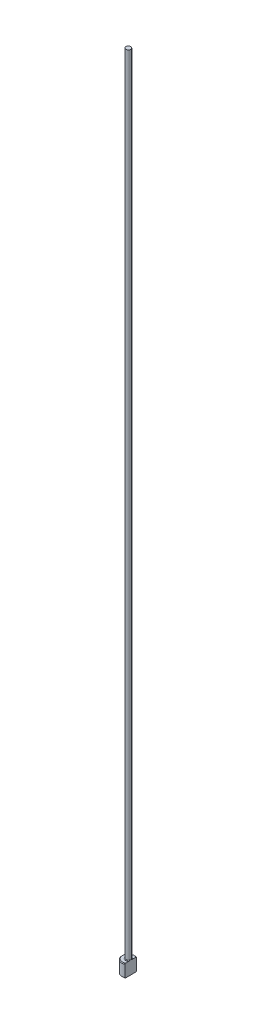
ISO-10303-21;
HEADER;
FILE_DESCRIPTION(('STEP AP214'),'2;1');
FILE_NAME('part.step','',(''),(''),'','','');
FILE_SCHEMA(('AUTOMOTIVE_DESIGN { 1 0 10303 214 1 1 1 1 }'));
ENDSEC;
DATA;
#1=APPLICATION_CONTEXT('core data for automotive mechanical design processes');
#2=APPLICATION_PROTOCOL_DEFINITION('international standard','automotive_design',2000,#1);
#3=PRODUCT_CONTEXT('',#1,'mechanical');
#4=PRODUCT('Part','Part','',(#3));
#5=PRODUCT_RELATED_PRODUCT_CATEGORY('part','',(#4));
#6=PRODUCT_DEFINITION_FORMATION('','',#4);
#7=PRODUCT_DEFINITION_CONTEXT('part definition',#1,'design');
#8=PRODUCT_DEFINITION('design','',#6,#7);
#9=PRODUCT_DEFINITION_SHAPE('','',#8);
#10=(LENGTH_UNIT() NAMED_UNIT(*) SI_UNIT(.MILLI.,.METRE.));
#11=(NAMED_UNIT(*) PLANE_ANGLE_UNIT() SI_UNIT($,.RADIAN.));
#12=(NAMED_UNIT(*) SI_UNIT($,.STERADIAN.) SOLID_ANGLE_UNIT());
#13=UNCERTAINTY_MEASURE_WITH_UNIT(LENGTH_MEASURE(1.E-05),#10,'distance_accuracy_value','');
#14=(GEOMETRIC_REPRESENTATION_CONTEXT(3) GLOBAL_UNCERTAINTY_ASSIGNED_CONTEXT((#13)) GLOBAL_UNIT_ASSIGNED_CONTEXT((#10,
#11,#12)) REPRESENTATION_CONTEXT('',''));
#15=CARTESIAN_POINT('',(0.,0.,0.));
#16=DIRECTION('',(0.,0.,1.));
#17=DIRECTION('',(1.,0.,0.));
#18=AXIS2_PLACEMENT_3D('',#15,#16,#17);
#19=CARTESIAN_POINT('',(0.,0.,0.));
#20=DIRECTION('',(0.,-1.,0.));
#21=DIRECTION('',(0.,0.,-1.));
#22=AXIS2_PLACEMENT_3D('',#19,#20,#21);
#23=PLANE('',#22);
#24=CARTESIAN_POINT('',(0.,0.,0.));
#25=DIRECTION('',(0.,-1.,0.));
#26=DIRECTION('',(0.,0.,-1.));
#27=AXIS2_PLACEMENT_3D('',#24,#25,#26);
#28=CIRCLE('',#27,1.8);
#29=CARTESIAN_POINT('',(0.749999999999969,0.,1.63630681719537));
#30=VERTEX_POINT('',#29);
#31=CARTESIAN_POINT('',(0.749999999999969,0.,-1.63630681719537));
#32=VERTEX_POINT('',#31);
#33=EDGE_CURVE('E98',#30,#32,#28,.T.);
#34=ORIENTED_EDGE('',*,*,#33,.T.);
#35=DIRECTION('',(0.,0.,1.));
#36=VECTOR('',#35,1.);
#37=CARTESIAN_POINT('',(0.749999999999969,0.,1.85404962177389));
#38=LINE('',#37,#36);
#39=EDGE_CURVE('E83',#32,#30,#38,.T.);
#40=ORIENTED_EDGE('',*,*,#39,.T.);
#41=EDGE_LOOP('',(#34,#40));
#42=FACE_BOUND('',#41,.T.);
#43=ADVANCED_FACE('F32',(#42),#23,.T.);
#44=CARTESIAN_POINT('',(0.,259.958771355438,0.));
#45=DIRECTION('',(0.,1.,0.));
#46=DIRECTION('',(0.,0.,1.));
#47=AXIS2_PLACEMENT_3D('',#44,#45,#46);
#48=CYLINDRICAL_SURFACE('',#47,1.99999999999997);
#49=CARTESIAN_POINT('',(0.,3.80000000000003,0.));
#50=DIRECTION('',(0.,1.,0.));
#51=DIRECTION('',(0.,0.,1.));
#52=AXIS2_PLACEMENT_3D('',#49,#50,#51);
#53=CIRCLE('',#52,1.99999999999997);
#54=CARTESIAN_POINT('',(0.749999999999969,3.80000000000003,1.85404962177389));
#55=VERTEX_POINT('',#54);
#56=CARTESIAN_POINT('',(0.749999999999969,3.80000000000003,-1.85404962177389));
#57=VERTEX_POINT('',#56);
#58=EDGE_CURVE('E104',#55,#57,#53,.F.);
#59=ORIENTED_EDGE('',*,*,#58,.T.);
#60=DIRECTION('',(0.,-1.,0.));
#61=VECTOR('',#60,1.);
#62=CARTESIAN_POINT('',(0.749999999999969,250.,-1.85404962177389));
#63=LINE('',#62,#61);
#64=CARTESIAN_POINT('',(0.749999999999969,0.199999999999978,-1.85404962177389));
#65=VERTEX_POINT('',#64);
#66=EDGE_CURVE('E183',#57,#65,#63,.T.);
#67=ORIENTED_EDGE('',*,*,#66,.T.);
#68=CARTESIAN_POINT('',(0.,0.199999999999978,0.));
#69=DIRECTION('',(0.,-1.,0.));
#70=DIRECTION('',(0.,0.,-1.));
#71=AXIS2_PLACEMENT_3D('',#68,#69,#70);
#72=CIRCLE('',#71,1.99999999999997);
#73=CARTESIAN_POINT('',(0.749999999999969,0.199999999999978,1.85404962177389));
#74=VERTEX_POINT('',#73);
#75=EDGE_CURVE('E100',#65,#74,#72,.F.);
#76=ORIENTED_EDGE('',*,*,#75,.T.);
#77=DIRECTION('',(0.,-1.,0.));
#78=VECTOR('',#77,1.);
#79=CARTESIAN_POINT('',(0.749999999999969,250.,1.85404962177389));
#80=LINE('',#79,#78);
#81=EDGE_CURVE('E93',#55,#74,#80,.T.);
#82=ORIENTED_EDGE('',*,*,#81,.F.);
#83=EDGE_LOOP('',(#59,#67,#76,#82));
#84=FACE_BOUND('',#83,.T.);
#85=ADVANCED_FACE('F158',(#84),#48,.T.);
#86=CARTESIAN_POINT('',(-1.99999999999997,4.,0.));
#87=DIRECTION('',(0.,1.,0.));
#88=DIRECTION('',(0.,0.,1.));
#89=AXIS2_PLACEMENT_3D('',#86,#87,#88);
#90=PLANE('',#89);
#91=CARTESIAN_POINT('',(0.,4.,0.));
#92=DIRECTION('',(0.,1.,0.));
#93=DIRECTION('',(0.,0.,1.));
#94=AXIS2_PLACEMENT_3D('',#91,#92,#93);
#95=CIRCLE('',#94,1.80000000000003);
#96=CARTESIAN_POINT('',(0.749999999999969,4.,-1.6363068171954));
#97=VERTEX_POINT('',#96);
#98=CARTESIAN_POINT('',(0.749999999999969,4.,1.6363068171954));
#99=VERTEX_POINT('',#98);
#100=EDGE_CURVE('E178',#97,#99,#95,.T.);
#101=ORIENTED_EDGE('',*,*,#100,.T.);
#102=DIRECTION('',(0.,0.,-1.));
#103=VECTOR('',#102,1.);
#104=CARTESIAN_POINT('',(0.749999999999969,4.,0.));
#105=LINE('',#104,#103);
#106=CARTESIAN_POINT('',(0.749999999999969,3.99999999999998,0.583095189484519));
#107=VERTEX_POINT('',#106);
#108=EDGE_CURVE('E57',#99,#107,#105,.T.);
#109=ORIENTED_EDGE('',*,*,#108,.T.);
#110=CARTESIAN_POINT('',(0.,4.,0.));
#111=DIRECTION('',(0.,1.,0.));
#112=DIRECTION('',(0.,0.,1.));
#113=AXIS2_PLACEMENT_3D('',#110,#111,#112);
#114=CIRCLE('',#113,0.949999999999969);
#115=CARTESIAN_POINT('',(0.749999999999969,3.99999999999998,-0.583095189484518));
#116=VERTEX_POINT('',#115);
#117=EDGE_CURVE('E107',#107,#116,#114,.F.);
#118=ORIENTED_EDGE('',*,*,#117,.T.);
#119=EDGE_CURVE('E136',#116,#97,#105,.T.);
#120=ORIENTED_EDGE('',*,*,#119,.T.);
#121=EDGE_LOOP('',(#101,#109,#118,#120));
#122=FACE_BOUND('',#121,.T.);
#123=ADVANCED_FACE('F147',(#122),#90,.T.);
#124=CARTESIAN_POINT('',(0.,4.,0.));
#125=DIRECTION('',(0.,-1.,0.));
#126=DIRECTION('',(0.,0.,-1.));
#127=AXIS2_PLACEMENT_3D('',#124,#125,#126);
#128=CONICAL_SURFACE('',#127,1.80000000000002,0.785398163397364);
#129=ORIENTED_EDGE('',*,*,#58,.F.);
#130=CARTESIAN_POINT('',(0.749999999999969,1.6493344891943,4.08234297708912));
#131=CARTESIAN_POINT('',(0.749999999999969,1.75686328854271,3.9730094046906));
#132=CARTESIAN_POINT('',(0.749999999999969,1.86432546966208,3.86361021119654));
#133=CARTESIAN_POINT('',(0.749999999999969,2.07918719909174,3.64450528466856));
#134=CARTESIAN_POINT('',(0.749999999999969,2.18658653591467,3.53479934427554));
#135=CARTESIAN_POINT('',(0.749999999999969,2.40330928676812,3.31294195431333));
#136=CARTESIAN_POINT('',(0.749999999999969,2.51262786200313,3.20078577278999));
#137=CARTESIAN_POINT('',(0.749999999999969,2.73079905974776,2.97627027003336));
#138=CARTESIAN_POINT('',(0.749999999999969,2.83965207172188,2.86391132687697));
#139=CARTESIAN_POINT('',(0.749999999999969,3.12410072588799,2.56910579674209));
#140=CARTESIAN_POINT('',(0.749999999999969,3.29932702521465,2.38630095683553));
#141=CARTESIAN_POINT('',(0.749999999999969,3.56081447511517,2.11005080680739));
#142=CARTESIAN_POINT('',(0.749999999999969,3.64793893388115,2.01742399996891));
#143=CARTESIAN_POINT('',(0.749999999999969,3.82126966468,1.83139888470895));
#144=CARTESIAN_POINT('',(0.749999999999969,3.90747636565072,1.7380009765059));
#145=CARTESIAN_POINT('',(0.749999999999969,4.07705927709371,1.55161637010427));
#146=CARTESIAN_POINT('',(0.749999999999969,4.1604586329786,1.4586508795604));
#147=CARTESIAN_POINT('',(0.749999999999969,4.28399832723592,1.31767418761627));
#148=CARTESIAN_POINT('',(0.749999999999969,4.32495686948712,1.27038111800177));
#149=CARTESIAN_POINT('',(0.749999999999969,4.4061281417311,1.17516037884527));
#150=CARTESIAN_POINT('',(0.749999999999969,4.44634090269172,1.1272327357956));
#151=CARTESIAN_POINT('',(0.749999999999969,4.52542294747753,1.03092047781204));
#152=CARTESIAN_POINT('',(0.749999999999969,4.56430041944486,0.982542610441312));
#153=CARTESIAN_POINT('',(0.749999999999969,4.64060877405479,0.884663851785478));
#154=CARTESIAN_POINT('',(0.749999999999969,4.67803993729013,0.835163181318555));
#155=CARTESIAN_POINT('',(0.749999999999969,4.75064212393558,0.734748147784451));
#156=CARTESIAN_POINT('',(0.749999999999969,4.78581957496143,0.683838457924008));
#157=CARTESIAN_POINT('',(0.749999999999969,4.85281471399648,0.57986856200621));
#158=CARTESIAN_POINT('',(0.749999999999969,4.88463648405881,0.52681108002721));
#159=CARTESIAN_POINT('',(0.749999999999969,4.92004236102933,0.460353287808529));
#160=CARTESIAN_POINT('',(0.749999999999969,4.92626425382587,0.448355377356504));
#161=CARTESIAN_POINT('',(0.749999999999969,4.93840821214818,0.424205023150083));
#162=CARTESIAN_POINT('',(0.749999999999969,4.94433019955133,0.412052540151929));
#163=CARTESIAN_POINT('',(0.749999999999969,4.96159246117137,0.375357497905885));
#164=CARTESIAN_POINT('',(0.749999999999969,4.97243059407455,0.350574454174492));
#165=CARTESIAN_POINT('',(0.749999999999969,4.99232429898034,0.300598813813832));
#166=CARTESIAN_POINT('',(0.749999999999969,5.00139743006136,0.275413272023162));
#167=CARTESIAN_POINT('',(0.749999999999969,5.0175253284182,0.224391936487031));
#168=CARTESIAN_POINT('',(0.749999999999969,5.02458006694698,0.198556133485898));
#169=CARTESIAN_POINT('',(0.749999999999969,5.03526259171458,0.150878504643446));
#170=CARTESIAN_POINT('',(0.749999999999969,5.03927292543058,0.129123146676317));
#171=CARTESIAN_POINT('',(0.749999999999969,5.04546996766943,0.0853625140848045));
#172=CARTESIAN_POINT('',(0.749999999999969,5.04765728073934,0.0633573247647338));
#173=CARTESIAN_POINT('',(0.749999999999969,5.05127090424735,-0.00270951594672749));
#174=CARTESIAN_POINT('',(0.749999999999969,5.04978253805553,-0.0469656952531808));
#175=CARTESIAN_POINT('',(0.749999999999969,5.03814860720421,-0.143936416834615));
#176=CARTESIAN_POINT('',(0.749999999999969,5.02621240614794,-0.196426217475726));
#177=CARTESIAN_POINT('',(0.749999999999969,5.00214641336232,-0.273272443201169));
#178=CARTESIAN_POINT('',(0.749999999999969,4.9930477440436,-0.298672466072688));
#179=CARTESIAN_POINT('',(0.749999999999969,4.97317462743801,-0.348806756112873));
#180=CARTESIAN_POINT('',(0.749999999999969,4.96240055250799,-0.373541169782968));
#181=CARTESIAN_POINT('',(0.749999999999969,4.92901260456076,-0.444792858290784));
#182=CARTESIAN_POINT('',(0.749999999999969,4.90460879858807,-0.49046421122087));
#183=CARTESIAN_POINT('',(0.749999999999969,4.85261191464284,-0.579972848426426));
#184=CARTESIAN_POINT('',(0.749999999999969,4.82501493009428,-0.623807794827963));
#185=CARTESIAN_POINT('',(0.749999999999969,4.7675980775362,-0.710209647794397));
#186=CARTESIAN_POINT('',(0.749999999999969,4.73777062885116,-0.752771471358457));
#187=CARTESIAN_POINT('',(0.749999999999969,4.67663657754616,-0.836824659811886));
#188=CARTESIAN_POINT('',(0.749999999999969,4.64532962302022,-0.878315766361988));
#189=CARTESIAN_POINT('',(0.749999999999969,4.58120898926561,-0.96106431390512));
#190=CARTESIAN_POINT('',(0.749999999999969,4.54838018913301,-1.00230998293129));
#191=CARTESIAN_POINT('',(0.749999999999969,4.48192435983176,-1.08415466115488));
#192=CARTESIAN_POINT('',(0.749999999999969,4.44829728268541,-1.12475363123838));
#193=CARTESIAN_POINT('',(0.749999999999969,4.34669509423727,-1.24559513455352));
#194=CARTESIAN_POINT('',(0.749999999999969,4.2778337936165,-1.32509096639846));
#195=CARTESIAN_POINT('',(0.749999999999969,4.10242211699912,-1.52396732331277));
#196=CARTESIAN_POINT('',(0.749999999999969,3.99494650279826,-1.64252540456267));
#197=CARTESIAN_POINT('',(0.749999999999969,3.77825048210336,-1.8780457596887));
#198=CARTESIAN_POINT('',(0.749999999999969,3.66902991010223,-1.99500788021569));
#199=CARTESIAN_POINT('',(0.749999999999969,3.44939263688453,-2.22808772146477));
#200=CARTESIAN_POINT('',(0.749999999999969,3.33897457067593,-2.34420415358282));
#201=CARTESIAN_POINT('',(0.749999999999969,3.11746229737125,-2.57577975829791));
#202=CARTESIAN_POINT('',(0.749999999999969,3.00636811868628,-2.69123895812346));
#203=CARTESIAN_POINT('',(0.749999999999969,2.7917128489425,-2.91342601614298));
#204=CARTESIAN_POINT('',(0.749999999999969,2.68818407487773,-3.0201851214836));
#205=CARTESIAN_POINT('',(0.749999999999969,2.48083134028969,-3.23341885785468));
#206=CARTESIAN_POINT('',(0.749999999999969,2.37700737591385,-3.33989348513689));
#207=CARTESIAN_POINT('',(0.749999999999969,2.16930389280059,-3.55245914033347));
#208=CARTESIAN_POINT('',(0.749999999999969,2.0654247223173,-3.658550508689));
#209=CARTESIAN_POINT('',(0.749999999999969,1.85749599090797,-3.87056274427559));
#210=CARTESIAN_POINT('',(0.749999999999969,1.75344643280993,-3.97648361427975));
#211=CARTESIAN_POINT('',(0.749999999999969,1.6493344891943,-4.08234297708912));
#212=B_SPLINE_CURVE_WITH_KNOTS('',3,(#130,#131,#132,#133,#134,#135,#136,#137,#138,#139,#140,
#141,#142,#143,#144,#145,#146,#147,#148,#149,#150,#151,#152,#153,#154,#155,#156,#157,#158,#159,
#160,#161,#162,#163,#164,#165,#166,#167,#168,#169,#170,#171,#172,#173,#174,#175,#176,#177,#178,
#179,#180,#181,#182,#183,#184,#185,#186,#187,#188,#189,#190,#191,#192,#193,#194,#195,#196,#197,
#198,#199,#200,#201,#202,#203,#204,#205,#206,#207,#208,#209,#210,#211),.UNSPECIFIED.,.F.,.F.,(4,
2,2,2,2,2,2,2,2,2,2,2,2,2,2,2,2,2,2,2,2,2,2,2,2,2,2,2,2,2,2,2,2,2,2,2,2,2,2,2,4),(0.,
0.460050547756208,0.920626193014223,1.39048289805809,1.85980320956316,2.61945882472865,
3.00094349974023,3.38224127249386,3.75689298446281,3.94457922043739,4.1322576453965,
4.31843090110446,4.50456785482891,4.69014785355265,4.87549943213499,4.91604145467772,
4.95659398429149,5.03768920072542,5.11793098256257,5.19817390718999,5.26446717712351,
5.33073845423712,5.46284570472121,5.62332534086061,5.70422568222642,5.78510806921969,
5.940234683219,6.09555312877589,6.25142580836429,6.40733575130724,6.56546927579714,
6.72361232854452,7.03910022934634,7.51913300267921,7.99921158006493,8.47991142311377,
8.96059120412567,9.4067310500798,9.85287674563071,10.2983160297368,10.7437479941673),.UNSPECIFIED.);
#213=EDGE_CURVE('E135',#55,#99,#212,.T.);
#214=ORIENTED_EDGE('',*,*,#213,.T.);
#215=ORIENTED_EDGE('',*,*,#100,.F.);
#216=EDGE_CURVE('E127',#97,#57,#212,.T.);
#217=ORIENTED_EDGE('',*,*,#216,.T.);
#218=EDGE_LOOP('',(#129,#214,#215,#217));
#219=FACE_BOUND('',#218,.T.);
#220=ADVANCED_FACE('F143',(#219),#128,.T.);
#221=CARTESIAN_POINT('',(0.,0.199999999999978,0.));
#222=DIRECTION('',(0.,1.,0.));
#223=DIRECTION('',(0.,0.,1.));
#224=AXIS2_PLACEMENT_3D('',#221,#222,#223);
#225=CONICAL_SURFACE('',#224,1.99999999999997,0.785398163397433);
#226=ORIENTED_EDGE('',*,*,#75,.F.);
#227=CARTESIAN_POINT('',(0.749999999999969,2.3506655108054,-4.08234297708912));
#228=CARTESIAN_POINT('',(0.749999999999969,2.24313671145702,-3.97300940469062));
#229=CARTESIAN_POINT('',(0.749999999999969,2.13567453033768,-3.86361021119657));
#230=CARTESIAN_POINT('',(0.749999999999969,1.92081280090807,-3.64450528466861));
#231=CARTESIAN_POINT('',(0.749999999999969,1.81341346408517,-3.5347993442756));
#232=CARTESIAN_POINT('',(0.749999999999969,1.59669071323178,-3.31294195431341));
#233=CARTESIAN_POINT('',(0.749999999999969,1.48737213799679,-3.20078577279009));
#234=CARTESIAN_POINT('',(0.749999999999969,1.26920094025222,-2.97627027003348));
#235=CARTESIAN_POINT('',(0.749999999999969,1.16034792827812,-2.86391132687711));
#236=CARTESIAN_POINT('',(0.749999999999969,0.87589927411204,-2.56910579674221));
#237=CARTESIAN_POINT('',(0.749999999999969,0.700672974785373,-2.38630095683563));
#238=CARTESIAN_POINT('',(0.749999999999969,0.439185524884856,-2.11005080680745));
#239=CARTESIAN_POINT('',(0.749999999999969,0.352061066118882,-2.01742399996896));
#240=CARTESIAN_POINT('',(0.749999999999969,0.178730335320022,-1.83139888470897));
#241=CARTESIAN_POINT('',(0.749999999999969,0.0925236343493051,-1.73800097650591));
#242=CARTESIAN_POINT('',(0.749999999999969,-0.07705927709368,-1.55161637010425));
#243=CARTESIAN_POINT('',(0.749999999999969,-0.160458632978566,-1.45865087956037));
#244=CARTESIAN_POINT('',(0.749999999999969,-0.283998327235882,-1.31767418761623));
#245=CARTESIAN_POINT('',(0.749999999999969,-0.324956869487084,-1.27038111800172));
#246=CARTESIAN_POINT('',(0.749999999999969,-0.406128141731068,-1.17516037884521));
#247=CARTESIAN_POINT('',(0.749999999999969,-0.446340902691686,-1.12723273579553));
#248=CARTESIAN_POINT('',(0.749999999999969,-0.525422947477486,-1.03092047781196));
#249=CARTESIAN_POINT('',(0.749999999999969,-0.564300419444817,-0.982542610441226));
#250=CARTESIAN_POINT('',(0.749999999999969,-0.64060877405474,-0.88466385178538));
#251=CARTESIAN_POINT('',(0.749999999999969,-0.678039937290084,-0.835163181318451));
#252=CARTESIAN_POINT('',(0.749999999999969,-0.750642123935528,-0.734748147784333));
#253=CARTESIAN_POINT('',(0.749999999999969,-0.785819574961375,-0.683838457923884));
#254=CARTESIAN_POINT('',(0.749999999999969,-0.85281471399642,-0.579868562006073));
#255=CARTESIAN_POINT('',(0.749999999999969,-0.884636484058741,-0.526811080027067));
#256=CARTESIAN_POINT('',(0.749999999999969,-0.920042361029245,-0.460353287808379));
#257=CARTESIAN_POINT('',(0.749999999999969,-0.926264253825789,-0.448355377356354));
#258=CARTESIAN_POINT('',(0.749999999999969,-0.938408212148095,-0.424205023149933));
#259=CARTESIAN_POINT('',(0.749999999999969,-0.944330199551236,-0.41205254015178));
#260=CARTESIAN_POINT('',(0.749999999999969,-0.96159246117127,-0.375357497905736));
#261=CARTESIAN_POINT('',(0.749999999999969,-0.972430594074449,-0.350574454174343));
#262=CARTESIAN_POINT('',(0.749999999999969,-0.992324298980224,-0.300598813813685));
#263=CARTESIAN_POINT('',(0.749999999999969,-1.00139743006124,-0.275413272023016));
#264=CARTESIAN_POINT('',(0.749999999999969,-1.01752532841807,-0.224391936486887));
#265=CARTESIAN_POINT('',(0.749999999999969,-1.02458006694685,-0.198556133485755));
#266=CARTESIAN_POINT('',(0.749999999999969,-1.03526259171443,-0.150878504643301));
#267=CARTESIAN_POINT('',(0.749999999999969,-1.03927292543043,-0.12912314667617));
#268=CARTESIAN_POINT('',(0.749999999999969,-1.04546996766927,-0.0853625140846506));
#269=CARTESIAN_POINT('',(0.749999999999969,-1.04765728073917,-0.0633573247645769));
#270=CARTESIAN_POINT('',(0.749999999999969,-1.05127090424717,0.00270951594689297));
#271=CARTESIAN_POINT('',(0.749999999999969,-1.04978253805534,0.046965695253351));
#272=CARTESIAN_POINT('',(0.749999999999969,-1.03814860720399,0.143936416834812));
#273=CARTESIAN_POINT('',(0.749999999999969,-1.02621240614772,0.196426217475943));
#274=CARTESIAN_POINT('',(0.749999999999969,-1.00214641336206,0.273272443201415));
#275=CARTESIAN_POINT('',(0.749999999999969,-0.993047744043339,0.298672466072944));
#276=CARTESIAN_POINT('',(0.749999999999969,-0.973174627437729,0.348806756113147));
#277=CARTESIAN_POINT('',(0.749999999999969,-0.9624005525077,0.373541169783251));
#278=CARTESIAN_POINT('',(0.749999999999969,-0.929012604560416,0.444792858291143));
#279=CARTESIAN_POINT('',(0.749999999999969,-0.904608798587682,0.490464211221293));
#280=CARTESIAN_POINT('',(0.749999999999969,-0.85261191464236,0.579972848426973));
#281=CARTESIAN_POINT('',(0.749999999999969,-0.825014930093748,0.62380779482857));
#282=CARTESIAN_POINT('',(0.749999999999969,-0.767598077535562,0.710209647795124));
#283=CARTESIAN_POINT('',(0.749999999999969,-0.737770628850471,0.752771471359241));
#284=CARTESIAN_POINT('',(0.749999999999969,-0.676636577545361,0.836824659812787));
#285=CARTESIAN_POINT('',(0.749999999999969,-0.645329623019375,0.878315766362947));
#286=CARTESIAN_POINT('',(0.749999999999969,-0.58120898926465,0.961064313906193));
#287=CARTESIAN_POINT('',(0.749999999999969,-0.548380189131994,1.00230998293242));
#288=CARTESIAN_POINT('',(0.749999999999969,-0.481924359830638,1.08415466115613));
#289=CARTESIAN_POINT('',(0.749999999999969,-0.448297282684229,1.12475363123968));
#290=CARTESIAN_POINT('',(0.749999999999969,-0.346695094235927,1.24559513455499));
#291=CARTESIAN_POINT('',(0.749999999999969,-0.277833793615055,1.32509096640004));
#292=CARTESIAN_POINT('',(0.749999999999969,-0.102422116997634,1.52396732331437));
#293=CARTESIAN_POINT('',(0.749999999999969,0.00505349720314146,1.64252540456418));
#294=CARTESIAN_POINT('',(0.749999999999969,0.221749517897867,1.87804575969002));
#295=CARTESIAN_POINT('',(0.749999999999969,0.330970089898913,1.99500788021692));
#296=CARTESIAN_POINT('',(0.749999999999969,0.550607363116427,2.22808772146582));
#297=CARTESIAN_POINT('',(0.749999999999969,0.661025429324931,2.34420415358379));
#298=CARTESIAN_POINT('',(0.749999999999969,0.882537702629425,2.57577975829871));
#299=CARTESIAN_POINT('',(0.749999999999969,0.993631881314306,2.69123895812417));
#300=CARTESIAN_POINT('',(0.749999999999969,1.20828715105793,2.91342601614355));
#301=CARTESIAN_POINT('',(0.749999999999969,1.31181592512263,3.02018512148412));
#302=CARTESIAN_POINT('',(0.749999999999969,1.51916865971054,3.2334188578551));
#303=CARTESIAN_POINT('',(0.749999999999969,1.62299262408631,3.33989348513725));
#304=CARTESIAN_POINT('',(0.749999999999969,1.83069610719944,3.55245914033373));
#305=CARTESIAN_POINT('',(0.749999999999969,1.93457527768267,3.65855050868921));
#306=CARTESIAN_POINT('',(0.749999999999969,2.14250400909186,3.87056274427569));
#307=CARTESIAN_POINT('',(0.749999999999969,2.24655356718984,3.9764836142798));
#308=CARTESIAN_POINT('',(0.749999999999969,2.3506655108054,4.08234297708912));
#309=B_SPLINE_CURVE_WITH_KNOTS('',3,(#227,#228,#229,#230,#231,#232,#233,#234,#235,#236,#237,
#238,#239,#240,#241,#242,#243,#244,#245,#246,#247,#248,#249,#250,#251,#252,#253,#254,#255,#256,
#257,#258,#259,#260,#261,#262,#263,#264,#265,#266,#267,#268,#269,#270,#271,#272,#273,#274,#275,
#276,#277,#278,#279,#280,#281,#282,#283,#284,#285,#286,#287,#288,#289,#290,#291,#292,#293,#294,
#295,#296,#297,#298,#299,#300,#301,#302,#303,#304,#305,#306,#307,#308),.UNSPECIFIED.,.F.,.F.,(4,
2,2,2,2,2,2,2,2,2,2,2,2,2,2,2,2,2,2,2,2,2,2,2,2,2,2,2,2,2,2,2,2,2,2,2,2,2,2,2,4),(0.,
0.460050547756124,0.920626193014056,1.39048289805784,1.85980320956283,2.61945882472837,
3.00094349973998,3.38224127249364,3.75689298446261,3.94457922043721,4.13225764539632,
4.3184309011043,4.50456785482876,4.69014785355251,4.87549943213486,4.91604145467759,
4.95659398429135,5.03768920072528,5.11793098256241,5.19817390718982,5.26446717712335,
5.33073845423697,5.46284570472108,5.62332534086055,5.70422568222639,5.78510806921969,
5.94023468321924,6.09555312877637,6.251425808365,6.40733575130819,6.56546927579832,
6.72361232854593,7.03910022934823,7.51913300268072,7.99921158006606,8.47991142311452,
8.96059120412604,9.40673105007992,9.85287674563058,10.2983160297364,10.7437479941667),.UNSPECIFIED.);
#310=EDGE_CURVE('E86',#65,#32,#309,.T.);
#311=ORIENTED_EDGE('',*,*,#310,.T.);
#312=ORIENTED_EDGE('',*,*,#33,.F.);
#313=EDGE_CURVE('E89',#30,#74,#309,.T.);
#314=ORIENTED_EDGE('',*,*,#313,.T.);
#315=EDGE_LOOP('',(#226,#311,#312,#314));
#316=FACE_BOUND('',#315,.T.);
#317=ADVANCED_FACE('F97',(#316),#225,.T.);
#318=CARTESIAN_POINT('',(0.,4.19999999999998,0.));
#319=DIRECTION('',(0.,1.,0.));
#320=DIRECTION('',(0.,0.,1.));
#321=AXIS2_PLACEMENT_3D('',#318,#319,#320);
#322=TOROIDAL_SURFACE('',#321,0.949999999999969,0.2);
#323=CARTESIAN_POINT('',(0.749999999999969,4.19999999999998,0.));
#324=CARTESIAN_POINT('',(0.749999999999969,4.20000052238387,0.));
#325=CARTESIAN_POINT('',(0.749999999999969,4.20000104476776,-7.92518434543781E-08));
#326=CARTESIAN_POINT('',(0.749999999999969,4.20000206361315,-3.453450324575E-07));
#327=CARTESIAN_POINT('',(0.749999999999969,4.20000255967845,-5.33493155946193E-07));
#328=CARTESIAN_POINT('',(0.749999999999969,4.20000354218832,-9.91557928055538E-07));
#329=CARTESIAN_POINT('',(0.749999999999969,4.20000402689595,-1.26510932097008E-06));
#330=CARTESIAN_POINT('',(0.749999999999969,4.20000495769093,-1.86638897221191E-06));
#331=CARTESIAN_POINT('',(0.749999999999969,4.20000540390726,-2.19392467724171E-06));
#332=CARTESIAN_POINT('',(0.749999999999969,4.20000683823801,-3.3337095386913E-06));
#333=CARTESIAN_POINT('',(0.749999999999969,4.20000776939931,-4.21820144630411E-06));
#334=CARTESIAN_POINT('',(0.749999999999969,4.20000948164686,-6.08403167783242E-06));
#335=CARTESIAN_POINT('',(0.749999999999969,4.20001026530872,-7.06314146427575E-06));
#336=CARTESIAN_POINT('',(0.749999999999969,4.20001305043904,-1.07283300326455E-05));
#337=CARTESIAN_POINT('',(0.749999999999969,4.20001489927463,-1.35334971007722E-05));
#338=CARTESIAN_POINT('',(0.749999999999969,4.20001806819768,-1.91887701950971E-05));
#339=CARTESIAN_POINT('',(0.749999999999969,4.20001941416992,-2.20250298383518E-05));
#340=CARTESIAN_POINT('',(0.749999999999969,4.20002483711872,-3.36357626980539E-05));
#341=CARTESIAN_POINT('',(0.749999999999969,4.20002876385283,-4.24755662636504E-05));
#342=CARTESIAN_POINT('',(0.749999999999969,4.20003535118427,-5.93015819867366E-05));
#343=CARTESIAN_POINT('',(0.749999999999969,4.20003811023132,-6.72480837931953E-05));
#344=CARTESIAN_POINT('',(0.749999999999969,4.20005910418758,-0.000122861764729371));
#345=CARTESIAN_POINT('',(0.749999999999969,4.2000847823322,-0.000167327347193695));
#346=CARTESIAN_POINT('',(0.749999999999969,4.20017912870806,-0.00033728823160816));
#347=CARTESIAN_POINT('',(0.749999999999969,4.20024226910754,-0.000465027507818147));
#348=CARTESIAN_POINT('',(0.749999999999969,4.20048606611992,-0.000950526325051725));
#349=CARTESIAN_POINT('',(0.749999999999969,4.20067249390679,-0.00130597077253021));
#350=CARTESIAN_POINT('',(0.749999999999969,4.20141452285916,-0.00272815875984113));
#351=CARTESIAN_POINT('',(0.749999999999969,4.20196367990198,-0.00379745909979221));
#352=CARTESIAN_POINT('',(0.749999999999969,4.21079317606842,-0.0209810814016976));
#353=CARTESIAN_POINT('',(0.749999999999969,4.21912708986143,-0.0370747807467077));
#354=CARTESIAN_POINT('',(0.749999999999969,4.23538169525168,-0.0687945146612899));
#355=CARTESIAN_POINT('',(0.749999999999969,4.24330692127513,-0.0844183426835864));
#356=CARTESIAN_POINT('',(0.749999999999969,4.25980152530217,-0.117412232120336));
#357=CARTESIAN_POINT('',(0.749999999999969,4.2683506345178,-0.134792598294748));
#358=CARTESIAN_POINT('',(0.749999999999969,4.28516256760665,-0.169887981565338));
#359=CARTESIAN_POINT('',(0.749999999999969,4.29342203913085,-0.187604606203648));
#360=CARTESIAN_POINT('',(0.749999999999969,4.31367684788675,-0.232718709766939));
#361=CARTESIAN_POINT('',(0.749999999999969,4.32533268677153,-0.260271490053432));
#362=CARTESIAN_POINT('',(0.749999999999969,4.34666110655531,-0.315501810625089));
#363=CARTESIAN_POINT('',(0.749999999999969,4.35636938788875,-0.343165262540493));
#364=CARTESIAN_POINT('',(0.749999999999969,4.37268127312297,-0.396748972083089));
#365=CARTESIAN_POINT('',(0.749999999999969,4.379483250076,-0.42260763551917));
#366=CARTESIAN_POINT('',(0.749999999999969,4.39076706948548,-0.476103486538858));
#367=CARTESIAN_POINT('',(0.749999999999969,4.39512718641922,-0.503767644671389));
#368=CARTESIAN_POINT('',(0.749999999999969,4.40012258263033,-0.559350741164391));
#369=CARTESIAN_POINT('',(0.749999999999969,4.40077276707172,-0.587268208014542));
#370=CARTESIAN_POINT('',(0.749999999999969,4.39725531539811,-0.642496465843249));
#371=CARTESIAN_POINT('',(0.749999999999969,4.39315871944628,-0.669810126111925));
#372=CARTESIAN_POINT('',(0.749999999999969,4.38226759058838,-0.710376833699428));
#373=CARTESIAN_POINT('',(0.749999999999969,4.37764112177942,-0.724213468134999));
#374=CARTESIAN_POINT('',(0.749999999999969,4.36645438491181,-0.751128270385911));
#375=CARTESIAN_POINT('',(0.749999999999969,4.3598916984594,-0.764205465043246));
#376=CARTESIAN_POINT('',(0.749999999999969,4.34591711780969,-0.787020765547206));
#377=CARTESIAN_POINT('',(0.749999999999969,4.33882518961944,-0.796953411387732));
#378=CARTESIAN_POINT('',(0.749999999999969,4.32312129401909,-0.815534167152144));
#379=CARTESIAN_POINT('',(0.749999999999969,4.31451194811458,-0.824184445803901));
#380=CARTESIAN_POINT('',(0.749999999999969,4.29770708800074,-0.838172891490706));
#381=CARTESIAN_POINT('',(0.749999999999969,4.2897756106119,-0.843827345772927));
#382=CARTESIAN_POINT('',(0.749999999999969,4.27308433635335,-0.853755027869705));
#383=CARTESIAN_POINT('',(0.749999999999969,4.26432487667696,-0.858028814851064));
#384=CARTESIAN_POINT('',(0.749999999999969,4.24611994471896,-0.864966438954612));
#385=CARTESIAN_POINT('',(0.749999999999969,4.23667052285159,-0.86762003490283));
#386=CARTESIAN_POINT('',(0.749999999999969,4.21743927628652,-0.871086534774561));
#387=CARTESIAN_POINT('',(0.749999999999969,4.207657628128,-0.871900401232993));
#388=CARTESIAN_POINT('',(0.749999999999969,4.18916476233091,-0.871644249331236));
#389=CARTESIAN_POINT('',(0.749999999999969,4.18045031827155,-0.870765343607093));
#390=CARTESIAN_POINT('',(0.749999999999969,4.16329782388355,-0.867547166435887));
#391=CARTESIAN_POINT('',(0.749999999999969,4.15485975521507,-0.865207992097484));
#392=CARTESIAN_POINT('',(0.749999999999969,4.138510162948,-0.859212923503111));
#393=CARTESIAN_POINT('',(0.749999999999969,4.13059660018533,-0.855562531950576));
#394=CARTESIAN_POINT('',(0.749999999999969,4.11540880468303,-0.847119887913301));
#395=CARTESIAN_POINT('',(0.749999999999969,4.10813470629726,-0.842327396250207));
#396=CARTESIAN_POINT('',(0.749999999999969,4.09350795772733,-0.831172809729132));
#397=CARTESIAN_POINT('',(0.749999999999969,4.08624574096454,-0.824692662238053));
#398=CARTESIAN_POINT('',(0.749999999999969,4.07268239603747,-0.810794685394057));
#399=CARTESIAN_POINT('',(0.749999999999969,4.06638225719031,-0.803375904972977));
#400=CARTESIAN_POINT('',(0.749999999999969,4.05147186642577,-0.783446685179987));
#401=CARTESIAN_POINT('',(0.749999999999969,4.04355238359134,-0.770417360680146));
#402=CARTESIAN_POINT('',(0.749999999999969,4.02991429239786,-0.743286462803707));
#403=CARTESIAN_POINT('',(0.749999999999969,4.02419651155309,-0.729184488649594));
#404=CARTESIAN_POINT('',(0.749999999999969,4.01257018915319,-0.693822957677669));
#405=CARTESIAN_POINT('',(0.749999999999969,4.00774380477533,-0.672209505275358));
#406=CARTESIAN_POINT('',(0.749999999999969,4.00145191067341,-0.628298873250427));
#407=CARTESIAN_POINT('',(0.749999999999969,4.0000267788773,-0.605996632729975));
#408=CARTESIAN_POINT('',(0.749999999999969,3.99995578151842,-0.54611119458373));
#409=CARTESIAN_POINT('',(0.749999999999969,4.00388309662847,-0.508527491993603));
#410=CARTESIAN_POINT('',(0.749999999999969,4.01373246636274,-0.453837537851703));
#411=CARTESIAN_POINT('',(0.749999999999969,4.01754666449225,-0.436272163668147));
#412=CARTESIAN_POINT('',(0.749999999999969,4.02621031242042,-0.401484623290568));
#413=CARTESIAN_POINT('',(0.749999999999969,4.03105449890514,-0.38426118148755));
#414=CARTESIAN_POINT('',(0.749999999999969,4.04486296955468,-0.339542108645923));
#415=CARTESIAN_POINT('',(0.749999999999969,4.05452531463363,-0.312264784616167));
#416=CARTESIAN_POINT('',(0.749999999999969,4.07570310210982,-0.257776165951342));
#417=CARTESIAN_POINT('',(0.749999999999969,4.08725400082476,-0.230578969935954));
#418=CARTESIAN_POINT('',(0.749999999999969,4.10733071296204,-0.185975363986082));
#419=CARTESIAN_POINT('',(0.749999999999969,4.11553018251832,-0.168419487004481));
#420=CARTESIAN_POINT('',(0.749999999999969,4.13221303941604,-0.133639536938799));
#421=CARTESIAN_POINT('',(0.749999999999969,4.14069316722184,-0.116413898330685));
#422=CARTESIAN_POINT('',(0.749999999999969,4.15705001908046,-0.0837133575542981));
#423=CARTESIAN_POINT('',(0.749999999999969,4.16490699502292,-0.0682284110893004));
#424=CARTESIAN_POINT('',(0.749999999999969,4.18101978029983,-0.0367899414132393));
#425=CARTESIAN_POINT('',(0.749999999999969,4.18928002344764,-0.0208385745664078));
#426=CARTESIAN_POINT('',(0.749999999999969,4.19803632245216,-0.00379745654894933));
#427=CARTESIAN_POINT('',(0.749999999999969,4.19858548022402,-0.00272815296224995));
#428=CARTESIAN_POINT('',(0.749999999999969,4.1993275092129,-0.00130596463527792));
#429=CARTESIAN_POINT('',(0.749999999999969,4.19951393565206,-0.000950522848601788));
#430=CARTESIAN_POINT('',(0.749999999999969,4.19975773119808,-0.000465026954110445));
#431=CARTESIAN_POINT('',(0.749999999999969,4.19982087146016,-0.00033728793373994));
#432=CARTESIAN_POINT('',(0.749999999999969,4.19991521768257,-0.000167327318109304));
#433=CARTESIAN_POINT('',(0.749999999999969,4.19994089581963,-0.000122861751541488));
#434=CARTESIAN_POINT('',(0.749999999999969,4.19996188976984,-6.72480870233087E-05));
#435=CARTESIAN_POINT('',(0.749999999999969,4.19996464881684,-5.93015850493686E-05));
#436=CARTESIAN_POINT('',(0.749999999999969,4.19997123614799,-4.24755688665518E-05));
#437=CARTESIAN_POINT('',(0.749999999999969,4.19997516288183,-3.36357649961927E-05));
#438=CARTESIAN_POINT('',(0.749999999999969,4.19998058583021,-2.20250315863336E-05));
#439=CARTESIAN_POINT('',(0.749999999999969,4.19998193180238,-1.91887717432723E-05));
#440=CARTESIAN_POINT('',(0.749999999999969,4.1999851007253,-1.35334982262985E-05));
#441=CARTESIAN_POINT('',(0.749999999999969,4.19998694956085,-1.07283309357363E-05));
#442=CARTESIAN_POINT('',(0.749999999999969,4.19998973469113,-7.06314207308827E-06));
#443=CARTESIAN_POINT('',(0.749999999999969,4.19999051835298,-6.08403221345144E-06));
#444=CARTESIAN_POINT('',(0.749999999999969,4.19999223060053,-4.21820183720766E-06));
#445=CARTESIAN_POINT('',(0.749999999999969,4.19999316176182,-3.33370985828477E-06));
#446=CARTESIAN_POINT('',(0.749999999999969,4.19999459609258,-2.19392490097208E-06));
#447=CARTESIAN_POINT('',(0.749999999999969,4.19999504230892,-1.86638916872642E-06));
#448=CARTESIAN_POINT('',(0.749999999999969,4.19999597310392,-1.26510946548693E-06));
#449=CARTESIAN_POINT('',(0.749999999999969,4.19999645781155,-9.91558047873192E-07));
#450=CARTESIAN_POINT('',(0.749999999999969,4.19999744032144,-5.33493231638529E-07));
#451=CARTESIAN_POINT('',(0.749999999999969,4.19999793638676,-3.45345088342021E-07));
#452=CARTESIAN_POINT('',(0.749999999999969,4.19999895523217,-7.92518659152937E-08));
#453=CARTESIAN_POINT('',(0.749999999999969,4.19999947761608,0.));
#454=CARTESIAN_POINT('',(0.749999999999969,4.19999999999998,0.));
#455=B_SPLINE_CURVE_WITH_KNOTS('',3,(#323,#324,#325,#326,#327,#328,#329,#330,#331,#332,#333,
#334,#335,#336,#337,#338,#339,#340,#341,#342,#343,#344,#345,#346,#347,#348,#349,#350,#351,#352,
#353,#354,#355,#356,#357,#358,#359,#360,#361,#362,#363,#364,#365,#366,#367,#368,#369,#370,#371,
#372,#373,#374,#375,#376,#377,#378,#379,#380,#381,#382,#383,#384,#385,#386,#387,#388,#389,#390,
#391,#392,#393,#394,#395,#396,#397,#398,#399,#400,#401,#402,#403,#404,#405,#406,#407,#408,#409,
#410,#411,#412,#413,#414,#415,#416,#417,#418,#419,#420,#421,#422,#423,#424,#425,#426,#427,#428,
#429,#430,#431,#432,#433,#434,#435,#436,#437,#438,#439,#440,#441,#442,#443,#444,#445,#446,#447,
#448,#449,#450,#451,#452,#453,#454),.UNSPECIFIED.,.T.,.F.,(4,2,2,2,2,2,2,2,2,2,2,2,2,2,2,2,2,2,
2,2,2,2,2,2,2,2,2,2,2,2,2,2,2,2,2,2,2,2,2,2,2,2,2,2,2,2,2,2,2,2,2,2,2,2,2,2,2,2,2,2,2,2,2,2,2,
4),(0.,1.56543919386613E-06,3.15006544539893E-06,4.81434341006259E-06,6.47280876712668E-06,
1.03067365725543E-05,1.40657946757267E-05,2.41046687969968E-05,3.35140856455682E-05,
6.25197195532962E-05,8.77289705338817E-05,0.000240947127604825,0.000669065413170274,
0.00187238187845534,0.00547938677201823,0.0598417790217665,0.112399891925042,0.170503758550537,
0.229141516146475,0.318850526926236,0.40672395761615,0.486842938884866,0.570663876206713,
0.654147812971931,0.736398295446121,0.780052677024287,0.823761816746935,0.860241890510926,
0.896659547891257,0.925764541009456,0.954857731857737,0.984132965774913,1.01339287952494,
1.03954157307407,1.06568852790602,1.09172701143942,1.11777095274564,1.14686281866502,
1.17598440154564,1.22146737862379,1.26696743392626,1.33303548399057,1.39988404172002,
1.51253340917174,1.56644503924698,1.62008752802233,1.70682485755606,1.79543193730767,
1.85355663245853,1.91115281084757,1.96324672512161,2.0171283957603,2.02073541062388,
2.0219387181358,2.02236683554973,2.02252005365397,2.02254526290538,2.02257426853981,
2.0225836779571,2.02259371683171,2.02259747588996,2.02260130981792,2.02260296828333,
2.02260463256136,2.02260621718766,2.0226077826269),.UNSPECIFIED.);
#456=CARTESIAN_POINT('',(0.749999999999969,4.19999999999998,0.));
#457=VERTEX_POINT('',#456);
#458=EDGE_CURVE('E11',#116,#457,#455,.T.);
#459=ORIENTED_EDGE('',*,*,#458,.F.);
#460=ORIENTED_EDGE('',*,*,#117,.F.);
#461=CARTESIAN_POINT('',(0.749999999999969,4.19999999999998,0.));
#462=CARTESIAN_POINT('',(0.749999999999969,4.19999947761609,0.));
#463=CARTESIAN_POINT('',(0.749999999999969,4.1999989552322,7.92518434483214E-08));
#464=CARTESIAN_POINT('',(0.749999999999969,4.19999793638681,3.45345032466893E-07));
#465=CARTESIAN_POINT('',(0.749999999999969,4.19999744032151,5.33493155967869E-07));
#466=CARTESIAN_POINT('',(0.749999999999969,4.19999645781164,9.91557928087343E-07));
#467=CARTESIAN_POINT('',(0.749999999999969,4.19999597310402,1.26510932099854E-06));
#468=CARTESIAN_POINT('',(0.749999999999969,4.19999504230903,1.86638897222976E-06));
#469=CARTESIAN_POINT('',(0.749999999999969,4.1999945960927,2.19392467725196E-06));
#470=CARTESIAN_POINT('',(0.749999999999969,4.19999316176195,3.33370953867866E-06));
#471=CARTESIAN_POINT('',(0.749999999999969,4.19999223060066,4.21820144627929E-06));
#472=CARTESIAN_POINT('',(0.749999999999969,4.1999905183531,6.08403167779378E-06));
#473=CARTESIAN_POINT('',(0.749999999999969,4.19998973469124,7.06314146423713E-06));
#474=CARTESIAN_POINT('',(0.749999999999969,4.19998694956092,1.07283300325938E-05));
#475=CARTESIAN_POINT('',(0.749999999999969,4.19998510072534,1.35334971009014E-05));
#476=CARTESIAN_POINT('',(0.749999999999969,4.19998193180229,1.91887701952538E-05));
#477=CARTESIAN_POINT('',(0.749999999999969,4.19998058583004,2.20250298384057E-05));
#478=CARTESIAN_POINT('',(0.749999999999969,4.19997516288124,3.36357626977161E-05));
#479=CARTESIAN_POINT('',(0.749999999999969,4.19997123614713,4.24755662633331E-05));
#480=CARTESIAN_POINT('',(0.749999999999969,4.19996464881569,5.93015819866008E-05));
#481=CARTESIAN_POINT('',(0.749999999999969,4.19996188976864,6.72480837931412E-05));
#482=CARTESIAN_POINT('',(0.749999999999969,4.19994089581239,0.000122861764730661));
#483=CARTESIAN_POINT('',(0.749999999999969,4.19991521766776,0.000167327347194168));
#484=CARTESIAN_POINT('',(0.749999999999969,4.19982087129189,0.000337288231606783));
#485=CARTESIAN_POINT('',(0.749999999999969,4.19975773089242,0.000465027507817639));
#486=CARTESIAN_POINT('',(0.749999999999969,4.19951393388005,0.000950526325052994));
#487=CARTESIAN_POINT('',(0.749999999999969,4.19932750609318,0.00130597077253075));
#488=CARTESIAN_POINT('',(0.749999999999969,4.1985854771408,0.00272815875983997));
#489=CARTESIAN_POINT('',(0.749999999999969,4.19803632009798,0.00379745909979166));
#490=CARTESIAN_POINT('',(0.749999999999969,4.18920682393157,0.0209810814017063));
#491=CARTESIAN_POINT('',(0.749999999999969,4.18087291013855,0.037074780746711));
#492=CARTESIAN_POINT('',(0.749999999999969,4.16461830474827,0.0687945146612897));
#493=CARTESIAN_POINT('',(0.749999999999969,4.15669307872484,0.084418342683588));
#494=CARTESIAN_POINT('',(0.749999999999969,4.14019847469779,0.117412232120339));
#495=CARTESIAN_POINT('',(0.749999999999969,4.13164936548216,0.13479259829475));
#496=CARTESIAN_POINT('',(0.749999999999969,4.11483743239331,0.169887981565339));
#497=CARTESIAN_POINT('',(0.749999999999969,4.10657796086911,0.187604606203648));
#498=CARTESIAN_POINT('',(0.749999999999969,4.08632315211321,0.232718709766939));
#499=CARTESIAN_POINT('',(0.749999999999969,4.07466731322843,0.260271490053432));
#500=CARTESIAN_POINT('',(0.749999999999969,4.05333889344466,0.315501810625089));
#501=CARTESIAN_POINT('',(0.749999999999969,4.04363061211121,0.343165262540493));
#502=CARTESIAN_POINT('',(0.749999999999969,4.02731872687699,0.396748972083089));
#503=CARTESIAN_POINT('',(0.749999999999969,4.02051674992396,0.42260763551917));
#504=CARTESIAN_POINT('',(0.749999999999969,4.00923293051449,0.476103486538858));
#505=CARTESIAN_POINT('',(0.749999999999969,4.00487281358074,0.503767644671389));
#506=CARTESIAN_POINT('',(0.749999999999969,3.99987741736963,0.559350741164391));
#507=CARTESIAN_POINT('',(0.749999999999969,3.99922723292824,0.587268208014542));
#508=CARTESIAN_POINT('',(0.749999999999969,4.00274468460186,0.642496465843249));
#509=CARTESIAN_POINT('',(0.749999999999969,4.00684128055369,0.669810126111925));
#510=CARTESIAN_POINT('',(0.749999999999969,4.01773240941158,0.710376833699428));
#511=CARTESIAN_POINT('',(0.749999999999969,4.02235887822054,0.724213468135));
#512=CARTESIAN_POINT('',(0.749999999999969,4.03354561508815,0.751128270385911));
#513=CARTESIAN_POINT('',(0.749999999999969,4.04010830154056,0.764205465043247));
#514=CARTESIAN_POINT('',(0.749999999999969,4.05408288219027,0.787020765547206));
#515=CARTESIAN_POINT('',(0.749999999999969,4.06117481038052,0.796953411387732));
#516=CARTESIAN_POINT('',(0.749999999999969,4.07687870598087,0.815534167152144));
#517=CARTESIAN_POINT('',(0.749999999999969,4.08548805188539,0.824184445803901));
#518=CARTESIAN_POINT('',(0.749999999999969,4.10229291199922,0.838172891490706));
#519=CARTESIAN_POINT('',(0.749999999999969,4.11022438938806,0.843827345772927));
#520=CARTESIAN_POINT('',(0.749999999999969,4.12691566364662,0.853755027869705));
#521=CARTESIAN_POINT('',(0.749999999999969,4.135675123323,0.858028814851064));
#522=CARTESIAN_POINT('',(0.749999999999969,4.153880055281,0.864966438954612));
#523=CARTESIAN_POINT('',(0.749999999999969,4.16332947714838,0.86762003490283));
#524=CARTESIAN_POINT('',(0.749999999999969,4.18256072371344,0.871086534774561));
#525=CARTESIAN_POINT('',(0.749999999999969,4.19234237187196,0.871900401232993));
#526=CARTESIAN_POINT('',(0.749999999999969,4.21083523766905,0.871644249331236));
#527=CARTESIAN_POINT('',(0.749999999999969,4.21954968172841,0.870765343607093));
#528=CARTESIAN_POINT('',(0.749999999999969,4.23670217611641,0.867547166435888));
#529=CARTESIAN_POINT('',(0.749999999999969,4.2451402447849,0.865207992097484));
#530=CARTESIAN_POINT('',(0.749999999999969,4.26148983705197,0.859212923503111));
#531=CARTESIAN_POINT('',(0.749999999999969,4.26940339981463,0.855562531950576));
#532=CARTESIAN_POINT('',(0.749999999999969,4.28459119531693,0.847119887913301));
#533=CARTESIAN_POINT('',(0.749999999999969,4.2918652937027,0.842327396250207));
#534=CARTESIAN_POINT('',(0.749999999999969,4.30649204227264,0.831172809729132));
#535=CARTESIAN_POINT('',(0.749999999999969,4.31375425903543,0.824692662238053));
#536=CARTESIAN_POINT('',(0.749999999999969,4.32731760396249,0.810794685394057));
#537=CARTESIAN_POINT('',(0.749999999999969,4.33361774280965,0.803375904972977));
#538=CARTESIAN_POINT('',(0.749999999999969,4.34852813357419,0.783446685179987));
#539=CARTESIAN_POINT('',(0.749999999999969,4.35644761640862,0.770417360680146));
#540=CARTESIAN_POINT('',(0.749999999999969,4.3700857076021,0.743286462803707));
#541=CARTESIAN_POINT('',(0.749999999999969,4.37580348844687,0.729184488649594));
#542=CARTESIAN_POINT('',(0.749999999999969,4.38742981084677,0.693822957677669));
#543=CARTESIAN_POINT('',(0.749999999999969,4.39225619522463,0.672209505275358));
#544=CARTESIAN_POINT('',(0.749999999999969,4.39854808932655,0.628298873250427));
#545=CARTESIAN_POINT('',(0.749999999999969,4.39997322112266,0.605996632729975));
#546=CARTESIAN_POINT('',(0.749999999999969,4.40004421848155,0.54611119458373));
#547=CARTESIAN_POINT('',(0.749999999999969,4.3961169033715,0.508527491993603));
#548=CARTESIAN_POINT('',(0.749999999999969,4.38626753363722,0.453837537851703));
#549=CARTESIAN_POINT('',(0.749999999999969,4.38245333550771,0.436272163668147));
#550=CARTESIAN_POINT('',(0.749999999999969,4.37378968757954,0.401484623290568));
#551=CARTESIAN_POINT('',(0.749999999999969,4.36894550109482,0.38426118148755));
#552=CARTESIAN_POINT('',(0.749999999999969,4.35513703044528,0.339542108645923));
#553=CARTESIAN_POINT('',(0.749999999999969,4.34547468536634,0.312264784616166));
#554=CARTESIAN_POINT('',(0.749999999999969,4.32429689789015,0.257776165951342));
#555=CARTESIAN_POINT('',(0.749999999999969,4.3127459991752,0.230578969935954));
#556=CARTESIAN_POINT('',(0.749999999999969,4.29266928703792,0.185975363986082));
#557=CARTESIAN_POINT('',(0.749999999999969,4.28446981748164,0.168419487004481));
#558=CARTESIAN_POINT('',(0.749999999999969,4.26778696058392,0.133639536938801));
#559=CARTESIAN_POINT('',(0.749999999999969,4.25930683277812,0.116413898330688));
#560=CARTESIAN_POINT('',(0.749999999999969,4.2429499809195,0.0837133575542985));
#561=CARTESIAN_POINT('',(0.749999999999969,4.23509300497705,0.0682284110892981));
#562=CARTESIAN_POINT('',(0.749999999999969,4.21898021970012,0.0367899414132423));
#563=CARTESIAN_POINT('',(0.749999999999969,4.2107199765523,0.020838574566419));
#564=CARTESIAN_POINT('',(0.749999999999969,4.20196367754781,0.00379745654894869));
#565=CARTESIAN_POINT('',(0.749999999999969,4.20141451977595,0.00272815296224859));
#566=CARTESIAN_POINT('',(0.749999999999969,4.20067249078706,0.00130596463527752));
#567=CARTESIAN_POINT('',(0.749999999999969,4.2004860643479,0.000950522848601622));
#568=CARTESIAN_POINT('',(0.749999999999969,4.20024226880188,0.00046502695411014));
#569=CARTESIAN_POINT('',(0.749999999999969,4.2001791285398,0.000337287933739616));
#570=CARTESIAN_POINT('',(0.749999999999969,4.20008478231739,0.000167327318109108));
#571=CARTESIAN_POINT('',(0.749999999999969,4.20005910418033,0.000122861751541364));
#572=CARTESIAN_POINT('',(0.749999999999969,4.20003811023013,6.72480870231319E-05));
#573=CARTESIAN_POINT('',(0.749999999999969,4.20003535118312,5.93015850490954E-05));
#574=CARTESIAN_POINT('',(0.749999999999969,4.20002876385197,4.24755688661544E-05));
#575=CARTESIAN_POINT('',(0.749999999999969,4.20002483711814,3.36357649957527E-05));
#576=CARTESIAN_POINT('',(0.749999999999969,4.20001941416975,2.20250315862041E-05));
#577=CARTESIAN_POINT('',(0.749999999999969,4.20001806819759,1.91887717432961E-05));
#578=CARTESIAN_POINT('',(0.749999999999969,4.20001489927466,1.35334982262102E-05));
#579=CARTESIAN_POINT('',(0.749999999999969,4.20001305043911,1.07283309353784E-05));
#580=CARTESIAN_POINT('',(0.749999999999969,4.20001026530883,7.06314207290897E-06));
#581=CARTESIAN_POINT('',(0.749999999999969,4.20000948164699,6.0840322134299E-06));
#582=CARTESIAN_POINT('',(0.749999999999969,4.20000776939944,4.21820183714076E-06));
#583=CARTESIAN_POINT('',(0.749999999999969,4.20000683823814,3.33370985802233E-06));
#584=CARTESIAN_POINT('',(0.749999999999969,4.20000540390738,2.1939249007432E-06));
#585=CARTESIAN_POINT('',(0.749999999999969,4.20000495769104,1.8663891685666E-06));
#586=CARTESIAN_POINT('',(0.749999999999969,4.20000402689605,1.26510946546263E-06));
#587=CARTESIAN_POINT('',(0.749999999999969,4.20000354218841,9.91558047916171E-07));
#588=CARTESIAN_POINT('',(0.749999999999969,4.20000255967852,5.33493231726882E-07));
#589=CARTESIAN_POINT('',(0.749999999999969,4.20000206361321,3.45345088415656E-07));
#590=CARTESIAN_POINT('',(0.749999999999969,4.20000104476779,7.92518659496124E-08));
#591=CARTESIAN_POINT('',(0.749999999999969,4.20000052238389,0.));
#592=CARTESIAN_POINT('',(0.749999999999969,4.19999999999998,0.));
#593=B_SPLINE_CURVE_WITH_KNOTS('',3,(#461,#462,#463,#464,#465,#466,#467,#468,#469,#470,#471,
#472,#473,#474,#475,#476,#477,#478,#479,#480,#481,#482,#483,#484,#485,#486,#487,#488,#489,#490,
#491,#492,#493,#494,#495,#496,#497,#498,#499,#500,#501,#502,#503,#504,#505,#506,#507,#508,#509,
#510,#511,#512,#513,#514,#515,#516,#517,#518,#519,#520,#521,#522,#523,#524,#525,#526,#527,#528,
#529,#530,#531,#532,#533,#534,#535,#536,#537,#538,#539,#540,#541,#542,#543,#544,#545,#546,#547,
#548,#549,#550,#551,#552,#553,#554,#555,#556,#557,#558,#559,#560,#561,#562,#563,#564,#565,#566,
#567,#568,#569,#570,#571,#572,#573,#574,#575,#576,#577,#578,#579,#580,#581,#582,#583,#584,#585,
#586,#587,#588,#589,#590,#591,#592),.UNSPECIFIED.,.T.,.F.,(4,2,2,2,2,2,2,2,2,2,2,2,2,2,2,2,2,2,
2,2,2,2,2,2,2,2,2,2,2,2,2,2,2,2,2,2,2,2,2,2,2,2,2,2,2,2,2,2,2,2,2,2,2,2,2,2,2,2,2,2,2,2,2,2,2,
4),(0.,1.5654391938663E-06,3.15006544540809E-06,4.81434341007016E-06,6.4728087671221E-06,
1.03067365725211E-05,1.40657946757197E-05,2.41046687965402E-05,3.35140856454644E-05,
6.25197195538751E-05,8.77289705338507E-05,0.000240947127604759,0.000669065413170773,
0.00187238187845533,0.00547938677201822,0.0598417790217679,0.112399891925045,0.170503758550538,
0.229141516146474,0.318850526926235,0.40672395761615,0.486842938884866,0.570663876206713,
0.654147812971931,0.736398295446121,0.780052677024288,0.823761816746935,0.860241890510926,
0.896659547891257,0.925764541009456,0.954857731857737,0.984132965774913,1.01339287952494,
1.03954157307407,1.06568852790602,1.09172701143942,1.11777095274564,1.14686281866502,
1.17598440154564,1.22146737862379,1.26696743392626,1.33303548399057,1.39988404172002,
1.51253340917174,1.56644503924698,1.62008752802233,1.70682485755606,1.79543193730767,
1.85355663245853,1.91115281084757,1.96324672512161,2.0171283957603,2.02073541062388,
2.0219387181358,2.02236683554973,2.02252005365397,2.02254526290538,2.02257426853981,
2.0225836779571,2.02259371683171,2.02259747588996,2.02260130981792,2.02260296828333,
2.02260463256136,2.02260621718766,2.0226077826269),.UNSPECIFIED.);
#594=EDGE_CURVE('E46',#457,#107,#593,.T.);
#595=ORIENTED_EDGE('',*,*,#594,.F.);
#596=CARTESIAN_POINT('',(0.,4.19999999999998,0.));
#597=DIRECTION('',(0.,1.,0.));
#598=DIRECTION('',(0.,0.,1.));
#599=AXIS2_PLACEMENT_3D('',#596,#597,#598);
#600=CIRCLE('',#599,0.749999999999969);
#601=EDGE_CURVE('E103',#457,#457,#600,.T.);
#602=ORIENTED_EDGE('',*,*,#601,.F.);
#603=EDGE_LOOP('',(#459,#460,#595,#602));
#604=FACE_BOUND('',#603,.T.);
#605=ADVANCED_FACE('F34',(#604),#322,.F.);
#606=CARTESIAN_POINT('',(0.,259.958771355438,0.));
#607=DIRECTION('',(0.,1.,0.));
#608=DIRECTION('',(0.,0.,1.));
#609=AXIS2_PLACEMENT_3D('',#606,#607,#608);
#610=CYLINDRICAL_SURFACE('',#609,0.749999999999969);
#611=ORIENTED_EDGE('',*,*,#601,.T.);
#612=EDGE_LOOP('',(#611));
#613=FACE_BOUND('',#612,.T.);
#614=CARTESIAN_POINT('',(0.,250.,0.));
#615=DIRECTION('',(0.,1.,0.));
#616=DIRECTION('',(0.,0.,1.));
#617=AXIS2_PLACEMENT_3D('',#614,#615,#616);
#618=CIRCLE('',#617,0.749999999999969);
#619=CARTESIAN_POINT('',(0.,250.,0.749999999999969));
#620=VERTEX_POINT('',#619);
#621=EDGE_CURVE('E101',#620,#620,#618,.T.);
#622=ORIENTED_EDGE('',*,*,#621,.F.);
#623=EDGE_LOOP('',(#622));
#624=FACE_BOUND('',#623,.T.);
#625=ADVANCED_FACE('F155',(#613,#624),#610,.T.);
#626=CARTESIAN_POINT('',(-0.749999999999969,250.,0.));
#627=DIRECTION('',(0.,1.,0.));
#628=DIRECTION('',(0.,0.,1.));
#629=AXIS2_PLACEMENT_3D('',#626,#627,#628);
#630=PLANE('',#629);
#631=ORIENTED_EDGE('',*,*,#621,.T.);
#632=EDGE_LOOP('',(#631));
#633=FACE_BOUND('',#632,.T.);
#634=ADVANCED_FACE('F121',(#633),#630,.T.);
#635=CARTESIAN_POINT('',(0.749999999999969,250.,1.85404962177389));
#636=DIRECTION('',(1.,0.,0.));
#637=DIRECTION('',(0.,0.,-1.));
#638=AXIS2_PLACEMENT_3D('',#635,#636,#637);
#639=PLANE('',#638);
#640=ORIENTED_EDGE('',*,*,#66,.F.);
#641=ORIENTED_EDGE('',*,*,#216,.F.);
#642=ORIENTED_EDGE('',*,*,#119,.F.);
#643=ORIENTED_EDGE('',*,*,#458,.T.);
#644=ORIENTED_EDGE('',*,*,#594,.T.);
#645=ORIENTED_EDGE('',*,*,#108,.F.);
#646=ORIENTED_EDGE('',*,*,#213,.F.);
#647=ORIENTED_EDGE('',*,*,#81,.T.);
#648=ORIENTED_EDGE('',*,*,#313,.F.);
#649=ORIENTED_EDGE('',*,*,#39,.F.);
#650=ORIENTED_EDGE('',*,*,#310,.F.);
#651=EDGE_LOOP('',(#640,#641,#642,#643,#644,#645,#646,#647,#648,#649,#650));
#652=FACE_BOUND('',#651,.T.);
#653=ADVANCED_FACE('F85',(#652),#639,.T.);
#654=CLOSED_SHELL('',(#43,#85,#123,#220,#317,#605,#625,#634,#653));
#655=MANIFOLD_SOLID_BREP('B2',#654);
#656=ADVANCED_BREP_SHAPE_REPRESENTATION('',(#18,#655),#14);
#657=SHAPE_DEFINITION_REPRESENTATION(#9,#656);
ENDSEC;
END-ISO-10303-21;
